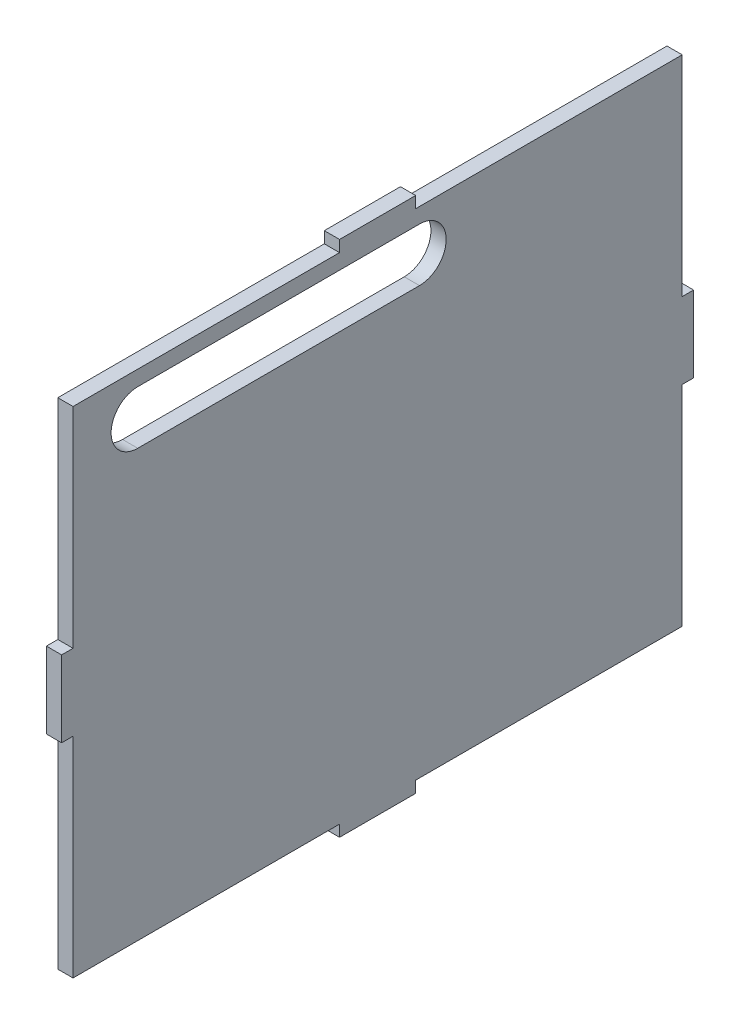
ISO-10303-21;
HEADER;
FILE_DESCRIPTION(('STEP AP214'),'2;1');
FILE_NAME('part.step','',(''),(''),'','','');
FILE_SCHEMA(('AUTOMOTIVE_DESIGN { 1 0 10303 214 1 1 1 1 }'));
ENDSEC;
DATA;
#1=APPLICATION_CONTEXT('core data for automotive mechanical design processes');
#2=APPLICATION_PROTOCOL_DEFINITION('international standard','automotive_design',2000,#1);
#3=PRODUCT_CONTEXT('',#1,'mechanical');
#4=PRODUCT('Part','Part','',(#3));
#5=PRODUCT_RELATED_PRODUCT_CATEGORY('part','',(#4));
#6=PRODUCT_DEFINITION_FORMATION('','',#4);
#7=PRODUCT_DEFINITION_CONTEXT('part definition',#1,'design');
#8=PRODUCT_DEFINITION('design','',#6,#7);
#9=PRODUCT_DEFINITION_SHAPE('','',#8);
#10=(LENGTH_UNIT() NAMED_UNIT(*) SI_UNIT(.MILLI.,.METRE.));
#11=(NAMED_UNIT(*) PLANE_ANGLE_UNIT() SI_UNIT($,.RADIAN.));
#12=(NAMED_UNIT(*) SI_UNIT($,.STERADIAN.) SOLID_ANGLE_UNIT());
#13=UNCERTAINTY_MEASURE_WITH_UNIT(LENGTH_MEASURE(1.E-05),#10,'distance_accuracy_value','');
#14=(GEOMETRIC_REPRESENTATION_CONTEXT(3) GLOBAL_UNCERTAINTY_ASSIGNED_CONTEXT((#13)) GLOBAL_UNIT_ASSIGNED_CONTEXT((#10,
#11,#12)) REPRESENTATION_CONTEXT('',''));
#15=CARTESIAN_POINT('',(0.,0.,0.));
#16=DIRECTION('',(0.,0.,1.));
#17=DIRECTION('',(1.,0.,0.));
#18=AXIS2_PLACEMENT_3D('',#15,#16,#17);
#19=CARTESIAN_POINT('',(2.,0.,80.));
#20=DIRECTION('',(0.,0.,1.));
#21=DIRECTION('',(1.,0.,0.));
#22=AXIS2_PLACEMENT_3D('',#19,#20,#21);
#23=PLANE('',#22);
#24=DIRECTION('',(0.,1.,0.));
#25=VECTOR('',#24,1.);
#26=CARTESIAN_POINT('',(0.,0.,80.));
#27=LINE('',#26,#25);
#28=CARTESIAN_POINT('',(0.,-65.,80.));
#29=VERTEX_POINT('',#28);
#30=CARTESIAN_POINT('',(0.,-37.5,80.));
#31=VERTEX_POINT('',#30);
#32=EDGE_CURVE('E247',#29,#31,#27,.T.);
#33=ORIENTED_EDGE('',*,*,#32,.F.);
#34=DIRECTION('',(-1.,0.,0.));
#35=VECTOR('',#34,1.);
#36=CARTESIAN_POINT('',(2.,-65.,80.));
#37=LINE('',#36,#35);
#38=CARTESIAN_POINT('',(2.,-65.,80.));
#39=VERTEX_POINT('',#38);
#40=EDGE_CURVE('E11',#39,#29,#37,.T.);
#41=ORIENTED_EDGE('',*,*,#40,.F.);
#42=DIRECTION('',(0.,1.,0.));
#43=VECTOR('',#42,1.);
#44=CARTESIAN_POINT('',(2.,0.,80.));
#45=LINE('',#44,#43);
#46=CARTESIAN_POINT('',(2.,-37.5,80.));
#47=VERTEX_POINT('',#46);
#48=EDGE_CURVE('E358',#39,#47,#45,.T.);
#49=ORIENTED_EDGE('',*,*,#48,.T.);
#50=DIRECTION('',(-1.,0.,0.));
#51=VECTOR('',#50,1.);
#52=CARTESIAN_POINT('',(2.,-37.5,80.));
#53=LINE('',#52,#51);
#54=EDGE_CURVE('E58',#47,#31,#53,.T.);
#55=ORIENTED_EDGE('',*,*,#54,.T.);
#56=EDGE_LOOP('',(#33,#41,#49,#55));
#57=FACE_BOUND('',#56,.T.);
#58=ADVANCED_FACE('F39',(#57),#23,.T.);
#59=CARTESIAN_POINT('',(2.,-65.,0.));
#60=DIRECTION('',(0.,-1.,0.));
#61=DIRECTION('',(0.,0.,-1.));
#62=AXIS2_PLACEMENT_3D('',#59,#60,#61);
#63=PLANE('',#62);
#64=DIRECTION('',(0.,0.,1.));
#65=VECTOR('',#64,1.);
#66=CARTESIAN_POINT('',(0.,-65.,0.));
#67=LINE('',#66,#65);
#68=CARTESIAN_POINT('',(0.,-65.,45.));
#69=VERTEX_POINT('',#68);
#70=EDGE_CURVE('E249',#69,#29,#67,.T.);
#71=ORIENTED_EDGE('',*,*,#70,.F.);
#72=DIRECTION('',(-1.,0.,0.));
#73=VECTOR('',#72,1.);
#74=CARTESIAN_POINT('',(2.,-65.,45.));
#75=LINE('',#74,#73);
#76=CARTESIAN_POINT('',(2.,-65.,45.));
#77=VERTEX_POINT('',#76);
#78=EDGE_CURVE('E49',#77,#69,#75,.T.);
#79=ORIENTED_EDGE('',*,*,#78,.F.);
#80=DIRECTION('',(0.,0.,1.));
#81=VECTOR('',#80,1.);
#82=CARTESIAN_POINT('',(2.,-65.,0.));
#83=LINE('',#82,#81);
#84=EDGE_CURVE('E365',#77,#39,#83,.T.);
#85=ORIENTED_EDGE('',*,*,#84,.T.);
#86=ORIENTED_EDGE('',*,*,#40,.T.);
#87=EDGE_LOOP('',(#71,#79,#85,#86));
#88=FACE_BOUND('',#87,.T.);
#89=ADVANCED_FACE('F418',(#88),#63,.T.);
#90=CARTESIAN_POINT('',(2.,0.,45.));
#91=DIRECTION('',(0.,0.,1.));
#92=DIRECTION('',(1.,0.,0.));
#93=AXIS2_PLACEMENT_3D('',#90,#91,#92);
#94=PLANE('',#93);
#95=DIRECTION('',(0.,1.,0.));
#96=VECTOR('',#95,1.);
#97=CARTESIAN_POINT('',(0.,0.,45.));
#98=LINE('',#97,#96);
#99=CARTESIAN_POINT('',(0.,-66.5,45.));
#100=VERTEX_POINT('',#99);
#101=EDGE_CURVE('E253',#100,#69,#98,.T.);
#102=ORIENTED_EDGE('',*,*,#101,.F.);
#103=DIRECTION('',(-1.,0.,0.));
#104=VECTOR('',#103,1.);
#105=CARTESIAN_POINT('',(2.,-66.5,45.));
#106=LINE('',#105,#104);
#107=CARTESIAN_POINT('',(2.,-66.5,45.));
#108=VERTEX_POINT('',#107);
#109=EDGE_CURVE('E330',#108,#100,#106,.T.);
#110=ORIENTED_EDGE('',*,*,#109,.F.);
#111=DIRECTION('',(0.,1.,0.));
#112=VECTOR('',#111,1.);
#113=CARTESIAN_POINT('',(2.,0.,45.));
#114=LINE('',#113,#112);
#115=EDGE_CURVE('E368',#108,#77,#114,.T.);
#116=ORIENTED_EDGE('',*,*,#115,.T.);
#117=ORIENTED_EDGE('',*,*,#78,.T.);
#118=EDGE_LOOP('',(#102,#110,#116,#117));
#119=FACE_BOUND('',#118,.T.);
#120=ADVANCED_FACE('F423',(#119),#94,.T.);
#121=CARTESIAN_POINT('',(2.,-66.5,0.));
#122=DIRECTION('',(0.,-1.,0.));
#123=DIRECTION('',(0.,0.,-1.));
#124=AXIS2_PLACEMENT_3D('',#121,#122,#123);
#125=PLANE('',#124);
#126=DIRECTION('',(0.,0.,1.));
#127=VECTOR('',#126,1.);
#128=CARTESIAN_POINT('',(0.,-66.5,0.));
#129=LINE('',#128,#127);
#130=CARTESIAN_POINT('',(0.,-66.5,35.));
#131=VERTEX_POINT('',#130);
#132=EDGE_CURVE('E257',#131,#100,#129,.T.);
#133=ORIENTED_EDGE('',*,*,#132,.F.);
#134=DIRECTION('',(-1.,0.,0.));
#135=VECTOR('',#134,1.);
#136=CARTESIAN_POINT('',(2.,-66.5,35.));
#137=LINE('',#136,#135);
#138=CARTESIAN_POINT('',(2.,-66.5,35.));
#139=VERTEX_POINT('',#138);
#140=EDGE_CURVE('E328',#139,#131,#137,.T.);
#141=ORIENTED_EDGE('',*,*,#140,.F.);
#142=DIRECTION('',(0.,0.,1.));
#143=VECTOR('',#142,1.);
#144=CARTESIAN_POINT('',(2.,-66.5,0.));
#145=LINE('',#144,#143);
#146=EDGE_CURVE('E372',#139,#108,#145,.T.);
#147=ORIENTED_EDGE('',*,*,#146,.T.);
#148=ORIENTED_EDGE('',*,*,#109,.T.);
#149=EDGE_LOOP('',(#133,#141,#147,#148));
#150=FACE_BOUND('',#149,.T.);
#151=ADVANCED_FACE('F494',(#150),#125,.T.);
#152=CARTESIAN_POINT('',(2.,0.,35.));
#153=DIRECTION('',(0.,0.,1.));
#154=DIRECTION('',(1.,0.,0.));
#155=AXIS2_PLACEMENT_3D('',#152,#153,#154);
#156=PLANE('',#155);
#157=DIRECTION('',(0.,1.,0.));
#158=VECTOR('',#157,1.);
#159=CARTESIAN_POINT('',(0.,0.,35.));
#160=LINE('',#159,#158);
#161=CARTESIAN_POINT('',(0.,-65.,35.));
#162=VERTEX_POINT('',#161);
#163=EDGE_CURVE('E260',#131,#162,#160,.T.);
#164=ORIENTED_EDGE('',*,*,#163,.T.);
#165=DIRECTION('',(-1.,0.,0.));
#166=VECTOR('',#165,1.);
#167=CARTESIAN_POINT('',(2.,-65.,35.));
#168=LINE('',#167,#166);
#169=CARTESIAN_POINT('',(2.,-65.,35.));
#170=VERTEX_POINT('',#169);
#171=EDGE_CURVE('E326',#170,#162,#168,.T.);
#172=ORIENTED_EDGE('',*,*,#171,.F.);
#173=DIRECTION('',(0.,1.,0.));
#174=VECTOR('',#173,1.);
#175=CARTESIAN_POINT('',(2.,0.,35.));
#176=LINE('',#175,#174);
#177=EDGE_CURVE('E375',#139,#170,#176,.T.);
#178=ORIENTED_EDGE('',*,*,#177,.F.);
#179=ORIENTED_EDGE('',*,*,#140,.T.);
#180=EDGE_LOOP('',(#164,#172,#178,#179));
#181=FACE_BOUND('',#180,.T.);
#182=ADVANCED_FACE('F491',(#181),#156,.F.);
#183=CARTESIAN_POINT('',(0.,-65.,0.));
#184=VERTEX_POINT('',#183);
#185=EDGE_CURVE('E254',#184,#162,#67,.T.);
#186=ORIENTED_EDGE('',*,*,#185,.F.);
#187=DIRECTION('',(-1.,0.,0.));
#188=VECTOR('',#187,1.);
#189=CARTESIAN_POINT('',(2.,-65.,0.));
#190=LINE('',#189,#188);
#191=CARTESIAN_POINT('',(2.,-65.,0.));
#192=VERTEX_POINT('',#191);
#193=EDGE_CURVE('E324',#192,#184,#190,.T.);
#194=ORIENTED_EDGE('',*,*,#193,.F.);
#195=EDGE_CURVE('E369',#192,#170,#83,.T.);
#196=ORIENTED_EDGE('',*,*,#195,.T.);
#197=ORIENTED_EDGE('',*,*,#171,.T.);
#198=EDGE_LOOP('',(#186,#194,#196,#197));
#199=FACE_BOUND('',#198,.T.);
#200=ADVANCED_FACE('F426',(#199),#63,.T.);
#201=CARTESIAN_POINT('',(2.,0.,0.));
#202=DIRECTION('',(0.,0.,1.));
#203=DIRECTION('',(1.,0.,0.));
#204=AXIS2_PLACEMENT_3D('',#201,#202,#203);
#205=PLANE('',#204);
#206=DIRECTION('',(0.,1.,0.));
#207=VECTOR('',#206,1.);
#208=CARTESIAN_POINT('',(0.,0.,0.));
#209=LINE('',#208,#207);
#210=CARTESIAN_POINT('',(0.,-37.5,0.));
#211=VERTEX_POINT('',#210);
#212=EDGE_CURVE('E263',#184,#211,#209,.T.);
#213=ORIENTED_EDGE('',*,*,#212,.T.);
#214=DIRECTION('',(-1.,0.,0.));
#215=VECTOR('',#214,1.);
#216=CARTESIAN_POINT('',(2.,-37.5,0.));
#217=LINE('',#216,#215);
#218=CARTESIAN_POINT('',(2.,-37.5,0.));
#219=VERTEX_POINT('',#218);
#220=EDGE_CURVE('E322',#219,#211,#217,.T.);
#221=ORIENTED_EDGE('',*,*,#220,.F.);
#222=DIRECTION('',(0.,1.,0.));
#223=VECTOR('',#222,1.);
#224=CARTESIAN_POINT('',(2.,0.,0.));
#225=LINE('',#224,#223);
#226=EDGE_CURVE('E377',#192,#219,#225,.T.);
#227=ORIENTED_EDGE('',*,*,#226,.F.);
#228=ORIENTED_EDGE('',*,*,#193,.T.);
#229=EDGE_LOOP('',(#213,#221,#227,#228));
#230=FACE_BOUND('',#229,.T.);
#231=ADVANCED_FACE('F457',(#230),#205,.F.);
#232=CARTESIAN_POINT('',(2.,-37.5,0.));
#233=DIRECTION('',(0.,-1.,0.));
#234=DIRECTION('',(0.,0.,-1.));
#235=AXIS2_PLACEMENT_3D('',#232,#233,#234);
#236=PLANE('',#235);
#237=DIRECTION('',(0.,0.,1.));
#238=VECTOR('',#237,1.);
#239=CARTESIAN_POINT('',(0.,-37.5,0.));
#240=LINE('',#239,#238);
#241=CARTESIAN_POINT('',(0.,-37.5,-1.5));
#242=VERTEX_POINT('',#241);
#243=EDGE_CURVE('E266',#242,#211,#240,.T.);
#244=ORIENTED_EDGE('',*,*,#243,.F.);
#245=DIRECTION('',(-1.,0.,0.));
#246=VECTOR('',#245,1.);
#247=CARTESIAN_POINT('',(2.,-37.5,-1.5));
#248=LINE('',#247,#246);
#249=CARTESIAN_POINT('',(2.,-37.5,-1.5));
#250=VERTEX_POINT('',#249);
#251=EDGE_CURVE('E320',#250,#242,#248,.T.);
#252=ORIENTED_EDGE('',*,*,#251,.F.);
#253=DIRECTION('',(0.,0.,1.));
#254=VECTOR('',#253,1.);
#255=CARTESIAN_POINT('',(2.,-37.5,0.));
#256=LINE('',#255,#254);
#257=EDGE_CURVE('E379',#250,#219,#256,.T.);
#258=ORIENTED_EDGE('',*,*,#257,.T.);
#259=ORIENTED_EDGE('',*,*,#220,.T.);
#260=EDGE_LOOP('',(#244,#252,#258,#259));
#261=FACE_BOUND('',#260,.T.);
#262=ADVANCED_FACE('F477',(#261),#236,.T.);
#263=CARTESIAN_POINT('',(2.,0.,-1.5));
#264=DIRECTION('',(0.,0.,1.));
#265=DIRECTION('',(1.,0.,0.));
#266=AXIS2_PLACEMENT_3D('',#263,#264,#265);
#267=PLANE('',#266);
#268=DIRECTION('',(0.,1.,0.));
#269=VECTOR('',#268,1.);
#270=CARTESIAN_POINT('',(0.,0.,-1.5));
#271=LINE('',#270,#269);
#272=CARTESIAN_POINT('',(0.,-27.5,-1.5));
#273=VERTEX_POINT('',#272);
#274=EDGE_CURVE('E270',#242,#273,#271,.T.);
#275=ORIENTED_EDGE('',*,*,#274,.T.);
#276=DIRECTION('',(-1.,0.,0.));
#277=VECTOR('',#276,1.);
#278=CARTESIAN_POINT('',(2.,-27.5,-1.5));
#279=LINE('',#278,#277);
#280=CARTESIAN_POINT('',(2.,-27.5,-1.5));
#281=VERTEX_POINT('',#280);
#282=EDGE_CURVE('E317',#281,#273,#279,.T.);
#283=ORIENTED_EDGE('',*,*,#282,.F.);
#284=DIRECTION('',(0.,1.,0.));
#285=VECTOR('',#284,1.);
#286=CARTESIAN_POINT('',(2.,0.,-1.5));
#287=LINE('',#286,#285);
#288=EDGE_CURVE('E383',#250,#281,#287,.T.);
#289=ORIENTED_EDGE('',*,*,#288,.F.);
#290=ORIENTED_EDGE('',*,*,#251,.T.);
#291=EDGE_LOOP('',(#275,#283,#289,#290));
#292=FACE_BOUND('',#291,.T.);
#293=ADVANCED_FACE('F474',(#292),#267,.F.);
#294=CARTESIAN_POINT('',(2.,-27.5,0.));
#295=DIRECTION('',(0.,-1.,0.));
#296=DIRECTION('',(0.,0.,-1.));
#297=AXIS2_PLACEMENT_3D('',#294,#295,#296);
#298=PLANE('',#297);
#299=DIRECTION('',(0.,0.,1.));
#300=VECTOR('',#299,1.);
#301=CARTESIAN_POINT('',(0.,-27.5,0.));
#302=LINE('',#301,#300);
#303=CARTESIAN_POINT('',(0.,-27.5,0.));
#304=VERTEX_POINT('',#303);
#305=EDGE_CURVE('E273',#273,#304,#302,.T.);
#306=ORIENTED_EDGE('',*,*,#305,.T.);
#307=DIRECTION('',(-1.,0.,0.));
#308=VECTOR('',#307,1.);
#309=CARTESIAN_POINT('',(2.,-27.5,0.));
#310=LINE('',#309,#308);
#311=CARTESIAN_POINT('',(2.,-27.5,0.));
#312=VERTEX_POINT('',#311);
#313=EDGE_CURVE('E314',#312,#304,#310,.T.);
#314=ORIENTED_EDGE('',*,*,#313,.F.);
#315=DIRECTION('',(0.,0.,1.));
#316=VECTOR('',#315,1.);
#317=CARTESIAN_POINT('',(2.,-27.5,0.));
#318=LINE('',#317,#316);
#319=EDGE_CURVE('E386',#281,#312,#318,.T.);
#320=ORIENTED_EDGE('',*,*,#319,.F.);
#321=ORIENTED_EDGE('',*,*,#282,.T.);
#322=EDGE_LOOP('',(#306,#314,#320,#321));
#323=FACE_BOUND('',#322,.T.);
#324=ADVANCED_FACE('F454',(#323),#298,.F.);
#325=CARTESIAN_POINT('',(0.,0.,0.));
#326=VERTEX_POINT('',#325);
#327=EDGE_CURVE('E267',#304,#326,#209,.T.);
#328=ORIENTED_EDGE('',*,*,#327,.T.);
#329=DIRECTION('',(-1.,0.,0.));
#330=VECTOR('',#329,1.);
#331=CARTESIAN_POINT('',(2.,0.,0.));
#332=LINE('',#331,#330);
#333=CARTESIAN_POINT('',(2.,0.,0.));
#334=VERTEX_POINT('',#333);
#335=EDGE_CURVE('E311',#334,#326,#332,.T.);
#336=ORIENTED_EDGE('',*,*,#335,.F.);
#337=EDGE_CURVE('E380',#312,#334,#225,.T.);
#338=ORIENTED_EDGE('',*,*,#337,.F.);
#339=ORIENTED_EDGE('',*,*,#313,.T.);
#340=EDGE_LOOP('',(#328,#336,#338,#339));
#341=FACE_BOUND('',#340,.T.);
#342=ADVANCED_FACE('F446',(#341),#205,.F.);
#343=CARTESIAN_POINT('',(2.,0.,0.));
#344=DIRECTION('',(0.,-1.,0.));
#345=DIRECTION('',(0.,0.,-1.));
#346=AXIS2_PLACEMENT_3D('',#343,#344,#345);
#347=PLANE('',#346);
#348=DIRECTION('',(0.,0.,1.));
#349=VECTOR('',#348,1.);
#350=CARTESIAN_POINT('',(0.,0.,0.));
#351=LINE('',#350,#349);
#352=CARTESIAN_POINT('',(0.,0.,35.));
#353=VERTEX_POINT('',#352);
#354=EDGE_CURVE('E276',#326,#353,#351,.T.);
#355=ORIENTED_EDGE('',*,*,#354,.T.);
#356=DIRECTION('',(-1.,0.,0.));
#357=VECTOR('',#356,1.);
#358=CARTESIAN_POINT('',(2.,0.,35.));
#359=LINE('',#358,#357);
#360=CARTESIAN_POINT('',(2.,0.,35.));
#361=VERTEX_POINT('',#360);
#362=EDGE_CURVE('E309',#361,#353,#359,.T.);
#363=ORIENTED_EDGE('',*,*,#362,.F.);
#364=DIRECTION('',(0.,0.,1.));
#365=VECTOR('',#364,1.);
#366=CARTESIAN_POINT('',(2.,0.,0.));
#367=LINE('',#366,#365);
#368=EDGE_CURVE('E389',#334,#361,#367,.T.);
#369=ORIENTED_EDGE('',*,*,#368,.F.);
#370=ORIENTED_EDGE('',*,*,#335,.T.);
#371=EDGE_LOOP('',(#355,#363,#369,#370));
#372=FACE_BOUND('',#371,.T.);
#373=ADVANCED_FACE('F437',(#372),#347,.F.);
#374=CARTESIAN_POINT('',(2.,0.,35.));
#375=DIRECTION('',(0.,0.,-1.));
#376=DIRECTION('',(-1.,0.,0.));
#377=AXIS2_PLACEMENT_3D('',#374,#375,#376);
#378=PLANE('',#377);
#379=DIRECTION('',(0.,-1.,0.));
#380=VECTOR('',#379,1.);
#381=CARTESIAN_POINT('',(0.,0.,35.));
#382=LINE('',#381,#380);
#383=CARTESIAN_POINT('',(0.,1.5,35.));
#384=VERTEX_POINT('',#383);
#385=EDGE_CURVE('E279',#384,#353,#382,.T.);
#386=ORIENTED_EDGE('',*,*,#385,.F.);
#387=DIRECTION('',(-1.,0.,0.));
#388=VECTOR('',#387,1.);
#389=CARTESIAN_POINT('',(2.,1.5,35.));
#390=LINE('',#389,#388);
#391=CARTESIAN_POINT('',(2.,1.5,35.));
#392=VERTEX_POINT('',#391);
#393=EDGE_CURVE('E307',#392,#384,#390,.T.);
#394=ORIENTED_EDGE('',*,*,#393,.F.);
#395=DIRECTION('',(0.,-1.,0.));
#396=VECTOR('',#395,1.);
#397=CARTESIAN_POINT('',(2.,0.,35.));
#398=LINE('',#397,#396);
#399=EDGE_CURVE('E391',#392,#361,#398,.T.);
#400=ORIENTED_EDGE('',*,*,#399,.T.);
#401=ORIENTED_EDGE('',*,*,#362,.T.);
#402=EDGE_LOOP('',(#386,#394,#400,#401));
#403=FACE_BOUND('',#402,.T.);
#404=ADVANCED_FACE('F445',(#403),#378,.T.);
#405=CARTESIAN_POINT('',(2.,1.5,0.));
#406=DIRECTION('',(0.,-1.,0.));
#407=DIRECTION('',(0.,0.,-1.));
#408=AXIS2_PLACEMENT_3D('',#405,#406,#407);
#409=PLANE('',#408);
#410=DIRECTION('',(0.,0.,1.));
#411=VECTOR('',#410,1.);
#412=CARTESIAN_POINT('',(0.,1.5,0.));
#413=LINE('',#412,#411);
#414=CARTESIAN_POINT('',(0.,1.5,45.));
#415=VERTEX_POINT('',#414);
#416=EDGE_CURVE('E283',#384,#415,#413,.T.);
#417=ORIENTED_EDGE('',*,*,#416,.T.);
#418=DIRECTION('',(-1.,0.,0.));
#419=VECTOR('',#418,1.);
#420=CARTESIAN_POINT('',(2.,1.5,45.));
#421=LINE('',#420,#419);
#422=CARTESIAN_POINT('',(2.,1.5,45.));
#423=VERTEX_POINT('',#422);
#424=EDGE_CURVE('E304',#423,#415,#421,.T.);
#425=ORIENTED_EDGE('',*,*,#424,.F.);
#426=DIRECTION('',(0.,0.,1.));
#427=VECTOR('',#426,1.);
#428=CARTESIAN_POINT('',(2.,1.5,0.));
#429=LINE('',#428,#427);
#430=EDGE_CURVE('E395',#392,#423,#429,.T.);
#431=ORIENTED_EDGE('',*,*,#430,.F.);
#432=ORIENTED_EDGE('',*,*,#393,.T.);
#433=EDGE_LOOP('',(#417,#425,#431,#432));
#434=FACE_BOUND('',#433,.T.);
#435=ADVANCED_FACE('F441',(#434),#409,.F.);
#436=CARTESIAN_POINT('',(2.,0.,45.));
#437=DIRECTION('',(0.,0.,-1.));
#438=DIRECTION('',(-1.,0.,0.));
#439=AXIS2_PLACEMENT_3D('',#436,#437,#438);
#440=PLANE('',#439);
#441=DIRECTION('',(0.,-1.,0.));
#442=VECTOR('',#441,1.);
#443=CARTESIAN_POINT('',(0.,0.,45.));
#444=LINE('',#443,#442);
#445=CARTESIAN_POINT('',(0.,0.,45.));
#446=VERTEX_POINT('',#445);
#447=EDGE_CURVE('E286',#415,#446,#444,.T.);
#448=ORIENTED_EDGE('',*,*,#447,.T.);
#449=DIRECTION('',(-1.,0.,0.));
#450=VECTOR('',#449,1.);
#451=CARTESIAN_POINT('',(2.,0.,45.));
#452=LINE('',#451,#450);
#453=CARTESIAN_POINT('',(2.,0.,45.));
#454=VERTEX_POINT('',#453);
#455=EDGE_CURVE('E301',#454,#446,#452,.T.);
#456=ORIENTED_EDGE('',*,*,#455,.F.);
#457=DIRECTION('',(0.,-1.,0.));
#458=VECTOR('',#457,1.);
#459=CARTESIAN_POINT('',(2.,0.,45.));
#460=LINE('',#459,#458);
#461=EDGE_CURVE('E397',#423,#454,#460,.T.);
#462=ORIENTED_EDGE('',*,*,#461,.F.);
#463=ORIENTED_EDGE('',*,*,#424,.T.);
#464=EDGE_LOOP('',(#448,#456,#462,#463));
#465=FACE_BOUND('',#464,.T.);
#466=ADVANCED_FACE('F435',(#465),#440,.F.);
#467=CARTESIAN_POINT('',(0.,0.,80.));
#468=VERTEX_POINT('',#467);
#469=EDGE_CURVE('E280',#446,#468,#351,.T.);
#470=ORIENTED_EDGE('',*,*,#469,.T.);
#471=DIRECTION('',(-1.,0.,0.));
#472=VECTOR('',#471,1.);
#473=CARTESIAN_POINT('',(2.,0.,80.));
#474=LINE('',#473,#472);
#475=CARTESIAN_POINT('',(2.,0.,80.));
#476=VERTEX_POINT('',#475);
#477=EDGE_CURVE('E299',#476,#468,#474,.T.);
#478=ORIENTED_EDGE('',*,*,#477,.F.);
#479=EDGE_CURVE('E392',#454,#476,#367,.T.);
#480=ORIENTED_EDGE('',*,*,#479,.F.);
#481=ORIENTED_EDGE('',*,*,#455,.T.);
#482=EDGE_LOOP('',(#470,#478,#480,#481));
#483=FACE_BOUND('',#482,.T.);
#484=ADVANCED_FACE('F430',(#483),#347,.F.);
#485=CARTESIAN_POINT('',(0.,-27.5,80.));
#486=VERTEX_POINT('',#485);
#487=EDGE_CURVE('E250',#486,#468,#27,.T.);
#488=ORIENTED_EDGE('',*,*,#487,.F.);
#489=DIRECTION('',(-1.,0.,0.));
#490=VECTOR('',#489,1.);
#491=CARTESIAN_POINT('',(2.,-27.5,80.));
#492=LINE('',#491,#490);
#493=CARTESIAN_POINT('',(2.,-27.5,80.));
#494=VERTEX_POINT('',#493);
#495=EDGE_CURVE('E226',#494,#486,#492,.T.);
#496=ORIENTED_EDGE('',*,*,#495,.F.);
#497=EDGE_CURVE('E216',#494,#476,#45,.T.);
#498=ORIENTED_EDGE('',*,*,#497,.T.);
#499=ORIENTED_EDGE('',*,*,#477,.T.);
#500=EDGE_LOOP('',(#488,#496,#498,#499));
#501=FACE_BOUND('',#500,.T.);
#502=ADVANCED_FACE('F403',(#501),#23,.T.);
#503=CARTESIAN_POINT('',(2.,-27.5,0.));
#504=DIRECTION('',(0.,-1.,0.));
#505=DIRECTION('',(0.,0.,-1.));
#506=AXIS2_PLACEMENT_3D('',#503,#504,#505);
#507=PLANE('',#506);
#508=DIRECTION('',(0.,0.,1.));
#509=VECTOR('',#508,1.);
#510=CARTESIAN_POINT('',(0.,-27.5,0.));
#511=LINE('',#510,#509);
#512=CARTESIAN_POINT('',(0.,-27.5,81.5));
#513=VERTEX_POINT('',#512);
#514=EDGE_CURVE('E223',#486,#513,#511,.T.);
#515=ORIENTED_EDGE('',*,*,#514,.T.);
#516=DIRECTION('',(-1.,0.,0.));
#517=VECTOR('',#516,1.);
#518=CARTESIAN_POINT('',(2.,-27.5,81.5));
#519=LINE('',#518,#517);
#520=CARTESIAN_POINT('',(2.,-27.5,81.5));
#521=VERTEX_POINT('',#520);
#522=EDGE_CURVE('E220',#521,#513,#519,.T.);
#523=ORIENTED_EDGE('',*,*,#522,.F.);
#524=DIRECTION('',(0.,0.,1.));
#525=VECTOR('',#524,1.);
#526=CARTESIAN_POINT('',(2.,-27.5,0.));
#527=LINE('',#526,#525);
#528=EDGE_CURVE('E208',#494,#521,#527,.T.);
#529=ORIENTED_EDGE('',*,*,#528,.F.);
#530=ORIENTED_EDGE('',*,*,#495,.T.);
#531=EDGE_LOOP('',(#515,#523,#529,#530));
#532=FACE_BOUND('',#531,.T.);
#533=ADVANCED_FACE('F221',(#532),#507,.F.);
#534=CARTESIAN_POINT('',(2.,0.,81.5));
#535=DIRECTION('',(0.,0.,1.));
#536=DIRECTION('',(1.,0.,0.));
#537=AXIS2_PLACEMENT_3D('',#534,#535,#536);
#538=PLANE('',#537);
#539=DIRECTION('',(0.,1.,0.));
#540=VECTOR('',#539,1.);
#541=CARTESIAN_POINT('',(0.,0.,81.5));
#542=LINE('',#541,#540);
#543=CARTESIAN_POINT('',(0.,-37.5,81.5));
#544=VERTEX_POINT('',#543);
#545=EDGE_CURVE('E290',#544,#513,#542,.T.);
#546=ORIENTED_EDGE('',*,*,#545,.F.);
#547=DIRECTION('',(-1.,0.,0.));
#548=VECTOR('',#547,1.);
#549=CARTESIAN_POINT('',(2.,-37.5,81.5));
#550=LINE('',#549,#548);
#551=CARTESIAN_POINT('',(2.,-37.5,81.5));
#552=VERTEX_POINT('',#551);
#553=EDGE_CURVE('E131',#552,#544,#550,.T.);
#554=ORIENTED_EDGE('',*,*,#553,.F.);
#555=DIRECTION('',(0.,1.,0.));
#556=VECTOR('',#555,1.);
#557=CARTESIAN_POINT('',(2.,0.,81.5));
#558=LINE('',#557,#556);
#559=EDGE_CURVE('E214',#552,#521,#558,.T.);
#560=ORIENTED_EDGE('',*,*,#559,.T.);
#561=ORIENTED_EDGE('',*,*,#522,.T.);
#562=EDGE_LOOP('',(#546,#554,#560,#561));
#563=FACE_BOUND('',#562,.T.);
#564=ADVANCED_FACE('F228',(#563),#538,.T.);
#565=CARTESIAN_POINT('',(2.,-5.5,71.5));
#566=DIRECTION('',(-1.,0.,0.));
#567=DIRECTION('',(0.,0.,1.));
#568=AXIS2_PLACEMENT_3D('',#565,#566,#567);
#569=CYLINDRICAL_SURFACE('',#568,3.50000000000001);
#570=CARTESIAN_POINT('',(0.,-5.5,71.5));
#571=DIRECTION('',(1.,0.,0.));
#572=DIRECTION('',(0.,0.,-1.));
#573=AXIS2_PLACEMENT_3D('',#570,#571,#572);
#574=CIRCLE('',#573,3.50000000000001);
#575=CARTESIAN_POINT('',(0.,-2.,71.5));
#576=VERTEX_POINT('',#575);
#577=CARTESIAN_POINT('',(0.,-9.,71.5));
#578=VERTEX_POINT('',#577);
#579=EDGE_CURVE('E235',#576,#578,#574,.T.);
#580=ORIENTED_EDGE('',*,*,#579,.F.);
#581=DIRECTION('',(-1.,0.,0.));
#582=VECTOR('',#581,1.);
#583=CARTESIAN_POINT('',(2.,-2.,71.5));
#584=LINE('',#583,#582);
#585=CARTESIAN_POINT('',(2.,-2.,71.5));
#586=VERTEX_POINT('',#585);
#587=EDGE_CURVE('E43',#586,#576,#584,.T.);
#588=ORIENTED_EDGE('',*,*,#587,.F.);
#589=CARTESIAN_POINT('',(2.,-5.5,71.5));
#590=DIRECTION('',(1.,0.,0.));
#591=DIRECTION('',(0.,0.,-1.));
#592=AXIS2_PLACEMENT_3D('',#589,#590,#591);
#593=CIRCLE('',#592,3.50000000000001);
#594=CARTESIAN_POINT('',(2.,-9.,71.5));
#595=VERTEX_POINT('',#594);
#596=EDGE_CURVE('E295',#586,#595,#593,.T.);
#597=ORIENTED_EDGE('',*,*,#596,.T.);
#598=DIRECTION('',(-1.,0.,0.));
#599=VECTOR('',#598,1.);
#600=CARTESIAN_POINT('',(2.,-9.,71.5));
#601=LINE('',#600,#599);
#602=EDGE_CURVE('E231',#595,#578,#601,.T.);
#603=ORIENTED_EDGE('',*,*,#602,.T.);
#604=EDGE_LOOP('',(#580,#588,#597,#603));
#605=FACE_BOUND('',#604,.T.);
#606=ADVANCED_FACE('F41',(#605),#569,.F.);
#607=CARTESIAN_POINT('',(2.,-2.,0.));
#608=DIRECTION('',(0.,-1.,0.));
#609=DIRECTION('',(0.,0.,-1.));
#610=AXIS2_PLACEMENT_3D('',#607,#608,#609);
#611=PLANE('',#610);
#612=DIRECTION('',(0.,0.,1.));
#613=VECTOR('',#612,1.);
#614=CARTESIAN_POINT('',(0.,-2.,0.));
#615=LINE('',#614,#613);
#616=CARTESIAN_POINT('',(0.,-2.,34.5));
#617=VERTEX_POINT('',#616);
#618=EDGE_CURVE('E238',#617,#576,#615,.T.);
#619=ORIENTED_EDGE('',*,*,#618,.F.);
#620=DIRECTION('',(-1.,0.,0.));
#621=VECTOR('',#620,1.);
#622=CARTESIAN_POINT('',(2.,-2.,34.5));
#623=LINE('',#622,#621);
#624=CARTESIAN_POINT('',(2.,-2.,34.5));
#625=VERTEX_POINT('',#624);
#626=EDGE_CURVE('E335',#625,#617,#623,.T.);
#627=ORIENTED_EDGE('',*,*,#626,.F.);
#628=DIRECTION('',(0.,0.,1.));
#629=VECTOR('',#628,1.);
#630=CARTESIAN_POINT('',(2.,-2.,0.));
#631=LINE('',#630,#629);
#632=EDGE_CURVE('E344',#625,#586,#631,.T.);
#633=ORIENTED_EDGE('',*,*,#632,.T.);
#634=ORIENTED_EDGE('',*,*,#587,.T.);
#635=EDGE_LOOP('',(#619,#627,#633,#634));
#636=FACE_BOUND('',#635,.T.);
#637=ADVANCED_FACE('F342',(#636),#611,.T.);
#638=CARTESIAN_POINT('',(2.,-5.5,34.5));
#639=DIRECTION('',(-1.,0.,0.));
#640=DIRECTION('',(0.,0.,1.));
#641=AXIS2_PLACEMENT_3D('',#638,#639,#640);
#642=CYLINDRICAL_SURFACE('',#641,3.5);
#643=CARTESIAN_POINT('',(0.,-5.5,34.5));
#644=DIRECTION('',(1.,0.,0.));
#645=DIRECTION('',(0.,0.,-1.));
#646=AXIS2_PLACEMENT_3D('',#643,#644,#645);
#647=CIRCLE('',#646,3.5);
#648=CARTESIAN_POINT('',(0.,-9.,34.5));
#649=VERTEX_POINT('',#648);
#650=EDGE_CURVE('E241',#649,#617,#647,.T.);
#651=ORIENTED_EDGE('',*,*,#650,.F.);
#652=DIRECTION('',(-1.,0.,0.));
#653=VECTOR('',#652,1.);
#654=CARTESIAN_POINT('',(2.,-9.,34.5));
#655=LINE('',#654,#653);
#656=CARTESIAN_POINT('',(2.,-9.,34.5));
#657=VERTEX_POINT('',#656);
#658=EDGE_CURVE('E334',#657,#649,#655,.T.);
#659=ORIENTED_EDGE('',*,*,#658,.F.);
#660=CARTESIAN_POINT('',(2.,-5.5,34.5));
#661=DIRECTION('',(1.,0.,0.));
#662=DIRECTION('',(0.,0.,-1.));
#663=AXIS2_PLACEMENT_3D('',#660,#661,#662);
#664=CIRCLE('',#663,3.5);
#665=EDGE_CURVE('E353',#657,#625,#664,.T.);
#666=ORIENTED_EDGE('',*,*,#665,.T.);
#667=ORIENTED_EDGE('',*,*,#626,.T.);
#668=EDGE_LOOP('',(#651,#659,#666,#667));
#669=FACE_BOUND('',#668,.T.);
#670=ADVANCED_FACE('F350',(#669),#642,.F.);
#671=CARTESIAN_POINT('',(2.,-9.,0.));
#672=DIRECTION('',(0.,-1.,0.));
#673=DIRECTION('',(0.,0.,-1.));
#674=AXIS2_PLACEMENT_3D('',#671,#672,#673);
#675=PLANE('',#674);
#676=DIRECTION('',(0.,0.,1.));
#677=VECTOR('',#676,1.);
#678=CARTESIAN_POINT('',(0.,-9.,0.));
#679=LINE('',#678,#677);
#680=EDGE_CURVE('E244',#649,#578,#679,.T.);
#681=ORIENTED_EDGE('',*,*,#680,.T.);
#682=ORIENTED_EDGE('',*,*,#602,.F.);
#683=DIRECTION('',(0.,0.,1.));
#684=VECTOR('',#683,1.);
#685=CARTESIAN_POINT('',(2.,-9.,0.));
#686=LINE('',#685,#684);
#687=EDGE_CURVE('E355',#657,#595,#686,.T.);
#688=ORIENTED_EDGE('',*,*,#687,.F.);
#689=ORIENTED_EDGE('',*,*,#658,.T.);
#690=EDGE_LOOP('',(#681,#682,#688,#689));
#691=FACE_BOUND('',#690,.T.);
#692=ADVANCED_FACE('F356',(#691),#675,.F.);
#693=CARTESIAN_POINT('',(2.,-37.5,0.));
#694=DIRECTION('',(0.,-1.,0.));
#695=DIRECTION('',(0.,0.,-1.));
#696=AXIS2_PLACEMENT_3D('',#693,#694,#695);
#697=PLANE('',#696);
#698=DIRECTION('',(0.,0.,1.));
#699=VECTOR('',#698,1.);
#700=CARTESIAN_POINT('',(0.,-37.5,0.));
#701=LINE('',#700,#699);
#702=EDGE_CURVE('E292',#31,#544,#701,.T.);
#703=ORIENTED_EDGE('',*,*,#702,.F.);
#704=ORIENTED_EDGE('',*,*,#54,.F.);
#705=DIRECTION('',(0.,0.,1.));
#706=VECTOR('',#705,1.);
#707=CARTESIAN_POINT('',(2.,-37.5,0.));
#708=LINE('',#707,#706);
#709=EDGE_CURVE('E229',#47,#552,#708,.T.);
#710=ORIENTED_EDGE('',*,*,#709,.T.);
#711=ORIENTED_EDGE('',*,*,#553,.T.);
#712=EDGE_LOOP('',(#703,#704,#710,#711));
#713=FACE_BOUND('',#712,.T.);
#714=ADVANCED_FACE('F406',(#713),#697,.T.);
#715=CARTESIAN_POINT('',(2.,0.,0.));
#716=DIRECTION('',(1.,0.,0.));
#717=DIRECTION('',(0.,0.,-1.));
#718=AXIS2_PLACEMENT_3D('',#715,#716,#717);
#719=PLANE('',#718);
#720=ORIENTED_EDGE('',*,*,#596,.F.);
#721=ORIENTED_EDGE('',*,*,#632,.F.);
#722=ORIENTED_EDGE('',*,*,#665,.F.);
#723=ORIENTED_EDGE('',*,*,#687,.T.);
#724=EDGE_LOOP('',(#720,#721,#722,#723));
#725=FACE_BOUND('',#724,.T.);
#726=ORIENTED_EDGE('',*,*,#48,.F.);
#727=ORIENTED_EDGE('',*,*,#84,.F.);
#728=ORIENTED_EDGE('',*,*,#115,.F.);
#729=ORIENTED_EDGE('',*,*,#146,.F.);
#730=ORIENTED_EDGE('',*,*,#177,.T.);
#731=ORIENTED_EDGE('',*,*,#195,.F.);
#732=ORIENTED_EDGE('',*,*,#226,.T.);
#733=ORIENTED_EDGE('',*,*,#257,.F.);
#734=ORIENTED_EDGE('',*,*,#288,.T.);
#735=ORIENTED_EDGE('',*,*,#319,.T.);
#736=ORIENTED_EDGE('',*,*,#337,.T.);
#737=ORIENTED_EDGE('',*,*,#368,.T.);
#738=ORIENTED_EDGE('',*,*,#399,.F.);
#739=ORIENTED_EDGE('',*,*,#430,.T.);
#740=ORIENTED_EDGE('',*,*,#461,.T.);
#741=ORIENTED_EDGE('',*,*,#479,.T.);
#742=ORIENTED_EDGE('',*,*,#497,.F.);
#743=ORIENTED_EDGE('',*,*,#528,.T.);
#744=ORIENTED_EDGE('',*,*,#559,.F.);
#745=ORIENTED_EDGE('',*,*,#709,.F.);
#746=EDGE_LOOP('',(#726,#727,#728,#729,#730,#731,#732,#733,#734,#735,#736,#737,#738,#739,#740,
#741,#742,#743,#744,#745));
#747=FACE_BOUND('',#746,.T.);
#748=ADVANCED_FACE('F211',(#725,#747),#719,.T.);
#749=CARTESIAN_POINT('',(0.,0.,0.));
#750=DIRECTION('',(1.,0.,0.));
#751=DIRECTION('',(0.,0.,-1.));
#752=AXIS2_PLACEMENT_3D('',#749,#750,#751);
#753=PLANE('',#752);
#754=ORIENTED_EDGE('',*,*,#579,.T.);
#755=ORIENTED_EDGE('',*,*,#680,.F.);
#756=ORIENTED_EDGE('',*,*,#650,.T.);
#757=ORIENTED_EDGE('',*,*,#618,.T.);
#758=EDGE_LOOP('',(#754,#755,#756,#757));
#759=FACE_BOUND('',#758,.T.);
#760=ORIENTED_EDGE('',*,*,#32,.T.);
#761=ORIENTED_EDGE('',*,*,#702,.T.);
#762=ORIENTED_EDGE('',*,*,#545,.T.);
#763=ORIENTED_EDGE('',*,*,#514,.F.);
#764=ORIENTED_EDGE('',*,*,#487,.T.);
#765=ORIENTED_EDGE('',*,*,#469,.F.);
#766=ORIENTED_EDGE('',*,*,#447,.F.);
#767=ORIENTED_EDGE('',*,*,#416,.F.);
#768=ORIENTED_EDGE('',*,*,#385,.T.);
#769=ORIENTED_EDGE('',*,*,#354,.F.);
#770=ORIENTED_EDGE('',*,*,#327,.F.);
#771=ORIENTED_EDGE('',*,*,#305,.F.);
#772=ORIENTED_EDGE('',*,*,#274,.F.);
#773=ORIENTED_EDGE('',*,*,#243,.T.);
#774=ORIENTED_EDGE('',*,*,#212,.F.);
#775=ORIENTED_EDGE('',*,*,#185,.T.);
#776=ORIENTED_EDGE('',*,*,#163,.F.);
#777=ORIENTED_EDGE('',*,*,#132,.T.);
#778=ORIENTED_EDGE('',*,*,#101,.T.);
#779=ORIENTED_EDGE('',*,*,#70,.T.);
#780=EDGE_LOOP('',(#760,#761,#762,#763,#764,#765,#766,#767,#768,#769,#770,#771,#772,#773,#774,
#775,#776,#777,#778,#779));
#781=FACE_BOUND('',#780,.T.);
#782=ADVANCED_FACE('F348',(#759,#781),#753,.F.);
#783=CLOSED_SHELL('',(#58,#89,#120,#151,#182,#200,#231,#262,#293,#324,#342,#373,#404,#435,#466,
#484,#502,#533,#564,#606,#637,#670,#692,#714,#748,#782));
#784=MANIFOLD_SOLID_BREP('B2',#783);
#785=ADVANCED_BREP_SHAPE_REPRESENTATION('',(#18,#784),#14);
#786=SHAPE_DEFINITION_REPRESENTATION(#9,#785);
ENDSEC;
END-ISO-10303-21;
